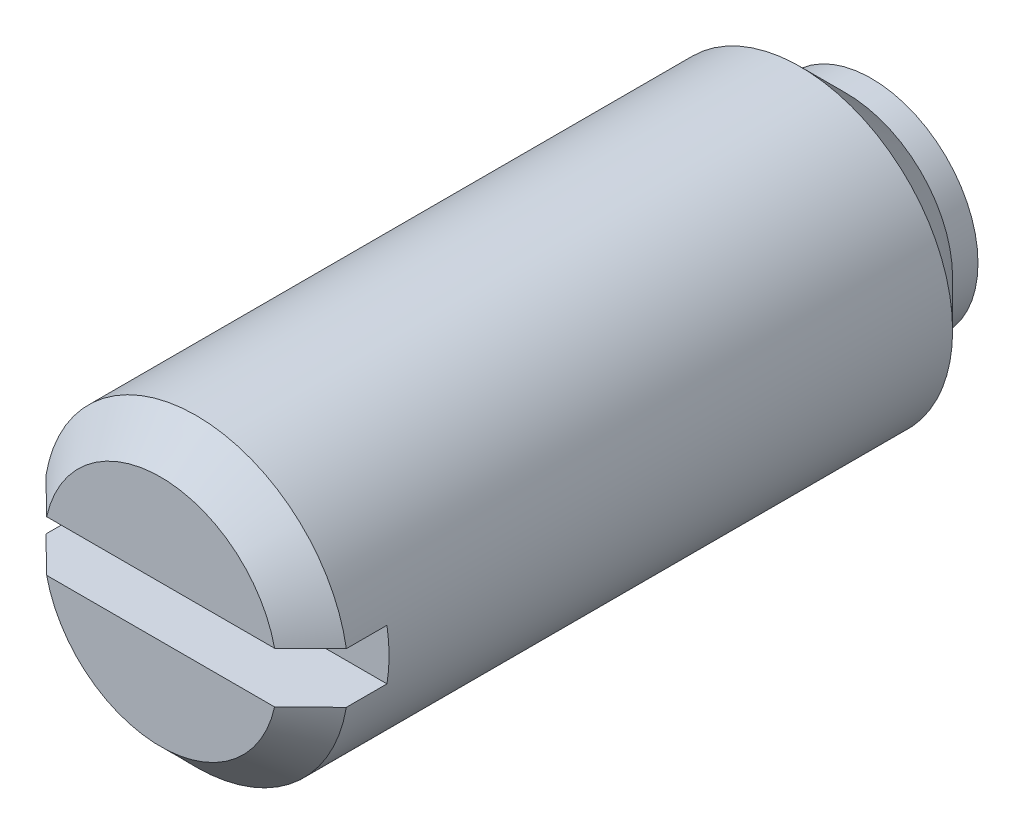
ISO-10303-21;
HEADER;
FILE_DESCRIPTION(('STEP AP214'),'2;1');
FILE_NAME('part.step','',(''),(''),'','','');
FILE_SCHEMA(('AUTOMOTIVE_DESIGN { 1 0 10303 214 1 1 1 1 }'));
ENDSEC;
DATA;
#1=APPLICATION_CONTEXT('core data for automotive mechanical design processes');
#2=APPLICATION_PROTOCOL_DEFINITION('international standard','automotive_design',2000,#1);
#3=PRODUCT_CONTEXT('',#1,'mechanical');
#4=PRODUCT('Part','Part','',(#3));
#5=PRODUCT_RELATED_PRODUCT_CATEGORY('part','',(#4));
#6=PRODUCT_DEFINITION_FORMATION('','',#4);
#7=PRODUCT_DEFINITION_CONTEXT('part definition',#1,'design');
#8=PRODUCT_DEFINITION('design','',#6,#7);
#9=PRODUCT_DEFINITION_SHAPE('','',#8);
#10=(LENGTH_UNIT() NAMED_UNIT(*) SI_UNIT(.MILLI.,.METRE.));
#11=(NAMED_UNIT(*) PLANE_ANGLE_UNIT() SI_UNIT($,.RADIAN.));
#12=(NAMED_UNIT(*) SI_UNIT($,.STERADIAN.) SOLID_ANGLE_UNIT());
#13=UNCERTAINTY_MEASURE_WITH_UNIT(LENGTH_MEASURE(1.E-05),#10,'distance_accuracy_value','');
#14=(GEOMETRIC_REPRESENTATION_CONTEXT(3) GLOBAL_UNCERTAINTY_ASSIGNED_CONTEXT((#13)) GLOBAL_UNIT_ASSIGNED_CONTEXT((#10,
#11,#12)) REPRESENTATION_CONTEXT('',''));
#15=CARTESIAN_POINT('',(0.,0.,0.));
#16=DIRECTION('',(0.,0.,1.));
#17=DIRECTION('',(1.,0.,0.));
#18=AXIS2_PLACEMENT_3D('',#15,#16,#17);
#19=CARTESIAN_POINT('',(0.,0.,-5.));
#20=DIRECTION('',(0.,0.,-1.));
#21=DIRECTION('',(-1.,0.,0.));
#22=AXIS2_PLACEMENT_3D('',#19,#20,#21);
#23=CYLINDRICAL_SURFACE('',#22,3.);
#24=DIRECTION('',(0.,0.,1.));
#25=VECTOR('',#24,1.);
#26=CARTESIAN_POINT('',(2.95803989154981,-0.5,13.5));
#27=LINE('',#26,#25);
#28=CARTESIAN_POINT('',(2.95803989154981,-0.5,13.5));
#29=VERTEX_POINT('',#28);
#30=CARTESIAN_POINT('',(2.95803989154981,-0.5,14.3));
#31=VERTEX_POINT('',#30);
#32=EDGE_CURVE('E83',#29,#31,#27,.T.);
#33=ORIENTED_EDGE('',*,*,#32,.T.);
#34=CARTESIAN_POINT('',(0.,0.,14.3));
#35=DIRECTION('',(0.,0.,1.));
#36=DIRECTION('',(1.,0.,0.));
#37=AXIS2_PLACEMENT_3D('',#34,#35,#36);
#38=CIRCLE('',#37,3.);
#39=CARTESIAN_POINT('',(-2.95803989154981,-0.5,14.3));
#40=VERTEX_POINT('',#39);
#41=EDGE_CURVE('E89',#31,#40,#38,.F.);
#42=ORIENTED_EDGE('',*,*,#41,.T.);
#43=DIRECTION('',(0.,0.,1.));
#44=VECTOR('',#43,1.);
#45=CARTESIAN_POINT('',(-2.95803989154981,-0.5,13.5));
#46=LINE('',#45,#44);
#47=CARTESIAN_POINT('',(-2.95803989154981,-0.5,13.5));
#48=VERTEX_POINT('',#47);
#49=EDGE_CURVE('E81',#48,#40,#46,.T.);
#50=ORIENTED_EDGE('',*,*,#49,.F.);
#51=CARTESIAN_POINT('',(0.,0.,13.5));
#52=DIRECTION('',(0.,0.,1.));
#53=DIRECTION('',(1.,0.,0.));
#54=AXIS2_PLACEMENT_3D('',#51,#52,#53);
#55=CIRCLE('',#54,3.);
#56=CARTESIAN_POINT('',(-2.95803989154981,0.5,13.5));
#57=VERTEX_POINT('',#56);
#58=EDGE_CURVE('E65',#57,#48,#55,.T.);
#59=ORIENTED_EDGE('',*,*,#58,.F.);
#60=DIRECTION('',(0.,0.,1.));
#61=VECTOR('',#60,1.);
#62=CARTESIAN_POINT('',(-2.95803989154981,0.5,13.5));
#63=LINE('',#62,#61);
#64=CARTESIAN_POINT('',(-2.95803989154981,0.5,14.3));
#65=VERTEX_POINT('',#64);
#66=EDGE_CURVE('E96',#57,#65,#63,.T.);
#67=ORIENTED_EDGE('',*,*,#66,.T.);
#68=CARTESIAN_POINT('',(0.,0.,14.3));
#69=DIRECTION('',(0.,0.,1.));
#70=DIRECTION('',(1.,0.,0.));
#71=AXIS2_PLACEMENT_3D('',#68,#69,#70);
#72=CIRCLE('',#71,3.);
#73=CARTESIAN_POINT('',(2.95803989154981,0.5,14.3));
#74=VERTEX_POINT('',#73);
#75=EDGE_CURVE('E101',#65,#74,#72,.F.);
#76=ORIENTED_EDGE('',*,*,#75,.T.);
#77=DIRECTION('',(0.,0.,1.));
#78=VECTOR('',#77,1.);
#79=CARTESIAN_POINT('',(2.95803989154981,0.5,13.5));
#80=LINE('',#79,#78);
#81=CARTESIAN_POINT('',(2.95803989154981,0.5,13.5));
#82=VERTEX_POINT('',#81);
#83=EDGE_CURVE('E91',#82,#74,#80,.T.);
#84=ORIENTED_EDGE('',*,*,#83,.F.);
#85=EDGE_CURVE('E77',#29,#82,#55,.T.);
#86=ORIENTED_EDGE('',*,*,#85,.F.);
#87=EDGE_LOOP('',(#33,#42,#50,#59,#67,#76,#84,#86));
#88=FACE_BOUND('',#87,.T.);
#89=CARTESIAN_POINT('',(0.,0.,2.4));
#90=DIRECTION('',(0.,0.,1.));
#91=DIRECTION('',(1.,0.,0.));
#92=AXIS2_PLACEMENT_3D('',#89,#90,#91);
#93=CIRCLE('',#92,3.);
#94=CARTESIAN_POINT('',(3.,0.,2.4));
#95=VERTEX_POINT('',#94);
#96=EDGE_CURVE('E165',#95,#95,#93,.T.);
#97=ORIENTED_EDGE('',*,*,#96,.T.);
#98=EDGE_LOOP('',(#97));
#99=FACE_BOUND('',#98,.T.);
#100=ADVANCED_FACE('F14',(#88,#99),#23,.T.);
#101=CARTESIAN_POINT('',(0.,3.,15.));
#102=DIRECTION('',(0.,0.,1.));
#103=DIRECTION('',(1.,0.,0.));
#104=AXIS2_PLACEMENT_3D('',#101,#102,#103);
#105=PLANE('',#104);
#106=DIRECTION('',(1.,0.,0.));
#107=VECTOR('',#106,1.);
#108=CARTESIAN_POINT('',(-2.95803989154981,0.5,15.));
#109=LINE('',#108,#107);
#110=CARTESIAN_POINT('',(-2.24499443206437,0.5,15.));
#111=VERTEX_POINT('',#110);
#112=CARTESIAN_POINT('',(2.24499443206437,0.5,15.));
#113=VERTEX_POINT('',#112);
#114=EDGE_CURVE('E75',#111,#113,#109,.T.);
#115=ORIENTED_EDGE('',*,*,#114,.T.);
#116=CARTESIAN_POINT('',(0.,0.,15.));
#117=DIRECTION('',(0.,0.,1.));
#118=DIRECTION('',(1.,0.,0.));
#119=AXIS2_PLACEMENT_3D('',#116,#117,#118);
#120=CIRCLE('',#119,2.3);
#121=EDGE_CURVE('E9',#113,#111,#120,.T.);
#122=ORIENTED_EDGE('',*,*,#121,.T.);
#123=EDGE_LOOP('',(#115,#122));
#124=FACE_BOUND('',#123,.T.);
#125=ADVANCED_FACE('F182',(#124),#105,.T.);
#126=DIRECTION('',(1.,0.,0.));
#127=VECTOR('',#126,1.);
#128=CARTESIAN_POINT('',(-2.95803989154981,-0.5,15.));
#129=LINE('',#128,#127);
#130=CARTESIAN_POINT('',(-2.24499443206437,-0.5,15.));
#131=VERTEX_POINT('',#130);
#132=CARTESIAN_POINT('',(2.24499443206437,-0.5,15.));
#133=VERTEX_POINT('',#132);
#134=EDGE_CURVE('E152',#131,#133,#129,.T.);
#135=ORIENTED_EDGE('',*,*,#134,.F.);
#136=CARTESIAN_POINT('',(0.,0.,15.));
#137=DIRECTION('',(0.,0.,1.));
#138=DIRECTION('',(1.,0.,0.));
#139=AXIS2_PLACEMENT_3D('',#136,#137,#138);
#140=CIRCLE('',#139,2.3);
#141=EDGE_CURVE('E146',#131,#133,#140,.T.);
#142=ORIENTED_EDGE('',*,*,#141,.T.);
#143=EDGE_LOOP('',(#135,#142));
#144=FACE_BOUND('',#143,.T.);
#145=ADVANCED_FACE('F132',(#144),#105,.T.);
#146=CARTESIAN_POINT('',(-2.95803989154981,0.5,13.5));
#147=DIRECTION('',(0.,-1.,0.));
#148=DIRECTION('',(1.,0.,0.));
#149=AXIS2_PLACEMENT_3D('',#146,#147,#148);
#150=PLANE('',#149);
#151=ORIENTED_EDGE('',*,*,#83,.T.);
#152=CARTESIAN_POINT('',(2.95803989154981,0.5,14.3));
#153=CARTESIAN_POINT('',(2.89874678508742,0.5,14.3584629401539));
#154=CARTESIAN_POINT('',(2.8394301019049,0.5,14.4169019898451));
#155=CARTESIAN_POINT('',(2.72073800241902,0.5,14.5337202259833));
#156=CARTESIAN_POINT('',(2.66136258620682,0.5,14.5920994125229));
#157=CARTESIAN_POINT('',(2.54254122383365,0.5,14.7087860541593));
#158=CARTESIAN_POINT('',(2.48309527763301,0.5,14.7670935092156));
#159=CARTESIAN_POINT('',(2.36411528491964,0.5,14.8836186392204));
#160=CARTESIAN_POINT('',(2.30458123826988,0.5,14.9418363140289));
#161=CARTESIAN_POINT('',(2.24499443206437,0.5,15.));
#162=B_SPLINE_CURVE_WITH_KNOTS('',3,(#152,#153,#154,#155,#156,#157,#158,#159,#160,#161),
.UNSPECIFIED.,.F.,.F.,(4,2,2,2,4),(0.,0.249804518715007,0.499608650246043,0.749412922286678,
0.999217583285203),.UNSPECIFIED.);
#163=EDGE_CURVE('E23',#74,#113,#162,.T.);
#164=ORIENTED_EDGE('',*,*,#163,.T.);
#165=ORIENTED_EDGE('',*,*,#114,.F.);
#166=CARTESIAN_POINT('',(-2.24499443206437,0.5,15.));
#167=CARTESIAN_POINT('',(-2.30458123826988,0.5,14.9418363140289));
#168=CARTESIAN_POINT('',(-2.36411528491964,0.5,14.8836186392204));
#169=CARTESIAN_POINT('',(-2.48309527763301,0.5,14.7670935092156));
#170=CARTESIAN_POINT('',(-2.54254122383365,0.5,14.7087860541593));
#171=CARTESIAN_POINT('',(-2.66136258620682,0.5,14.5920994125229));
#172=CARTESIAN_POINT('',(-2.72073800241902,0.5,14.5337202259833));
#173=CARTESIAN_POINT('',(-2.8394301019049,0.5,14.4169019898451));
#174=CARTESIAN_POINT('',(-2.89874678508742,0.5,14.3584629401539));
#175=CARTESIAN_POINT('',(-2.95803989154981,0.5,14.3));
#176=B_SPLINE_CURVE_WITH_KNOTS('',3,(#166,#167,#168,#169,#170,#171,#172,#173,#174,#175),
.UNSPECIFIED.,.F.,.F.,(4,2,2,2,4),(0.,0.249804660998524,0.49960893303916,0.749413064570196,
0.999217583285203),.UNSPECIFIED.);
#177=EDGE_CURVE('E137',#111,#65,#176,.T.);
#178=ORIENTED_EDGE('',*,*,#177,.T.);
#179=ORIENTED_EDGE('',*,*,#66,.F.);
#180=DIRECTION('',(1.,0.,0.));
#181=VECTOR('',#180,1.);
#182=CARTESIAN_POINT('',(-2.95803989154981,0.5,13.5));
#183=LINE('',#182,#181);
#184=EDGE_CURVE('E71',#57,#82,#183,.T.);
#185=ORIENTED_EDGE('',*,*,#184,.T.);
#186=EDGE_LOOP('',(#151,#164,#165,#178,#179,#185));
#187=FACE_BOUND('',#186,.T.);
#188=ADVANCED_FACE('F125',(#187),#150,.T.);
#189=CARTESIAN_POINT('',(-2.95803989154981,-0.5,13.5));
#190=DIRECTION('',(0.,-1.,0.));
#191=DIRECTION('',(1.,0.,0.));
#192=AXIS2_PLACEMENT_3D('',#189,#190,#191);
#193=PLANE('',#192);
#194=ORIENTED_EDGE('',*,*,#49,.T.);
#195=CARTESIAN_POINT('',(-2.95803989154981,-0.5,14.3));
#196=CARTESIAN_POINT('',(-2.89874678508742,-0.5,14.3584629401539));
#197=CARTESIAN_POINT('',(-2.8394301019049,-0.5,14.4169019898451));
#198=CARTESIAN_POINT('',(-2.72073800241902,-0.5,14.5337202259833));
#199=CARTESIAN_POINT('',(-2.66136258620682,-0.5,14.5920994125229));
#200=CARTESIAN_POINT('',(-2.54254122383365,-0.5,14.7087860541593));
#201=CARTESIAN_POINT('',(-2.48309527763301,-0.5,14.7670935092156));
#202=CARTESIAN_POINT('',(-2.36411528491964,-0.5,14.8836186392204));
#203=CARTESIAN_POINT('',(-2.30458123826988,-0.5,14.9418363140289));
#204=CARTESIAN_POINT('',(-2.24499443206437,-0.5,15.));
#205=B_SPLINE_CURVE_WITH_KNOTS('',3,(#195,#196,#197,#198,#199,#200,#201,#202,#203,#204),
.UNSPECIFIED.,.F.,.F.,(4,2,2,2,4),(0.,0.249804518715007,0.499608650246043,0.749412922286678,
0.999217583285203),.UNSPECIFIED.);
#206=EDGE_CURVE('E112',#40,#131,#205,.T.);
#207=ORIENTED_EDGE('',*,*,#206,.T.);
#208=ORIENTED_EDGE('',*,*,#134,.T.);
#209=CARTESIAN_POINT('',(2.24499443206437,-0.5,15.));
#210=CARTESIAN_POINT('',(2.30458123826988,-0.5,14.9418363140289));
#211=CARTESIAN_POINT('',(2.36411528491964,-0.5,14.8836186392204));
#212=CARTESIAN_POINT('',(2.48309527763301,-0.5,14.7670935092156));
#213=CARTESIAN_POINT('',(2.54254122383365,-0.5,14.7087860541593));
#214=CARTESIAN_POINT('',(2.66136258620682,-0.5,14.5920994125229));
#215=CARTESIAN_POINT('',(2.72073800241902,-0.5,14.5337202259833));
#216=CARTESIAN_POINT('',(2.8394301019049,-0.5,14.4169019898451));
#217=CARTESIAN_POINT('',(2.89874678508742,-0.5,14.3584629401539));
#218=CARTESIAN_POINT('',(2.95803989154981,-0.5,14.3));
#219=B_SPLINE_CURVE_WITH_KNOTS('',3,(#209,#210,#211,#212,#213,#214,#215,#216,#217,#218),
.UNSPECIFIED.,.F.,.F.,(4,2,2,2,4),(0.,0.249804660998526,0.49960893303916,0.749413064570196,
0.999217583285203),.UNSPECIFIED.);
#220=EDGE_CURVE('E105',#133,#31,#219,.T.);
#221=ORIENTED_EDGE('',*,*,#220,.T.);
#222=ORIENTED_EDGE('',*,*,#32,.F.);
#223=DIRECTION('',(1.,0.,0.));
#224=VECTOR('',#223,1.);
#225=CARTESIAN_POINT('',(-2.95803989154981,-0.5,13.5));
#226=LINE('',#225,#224);
#227=EDGE_CURVE('E68',#48,#29,#226,.T.);
#228=ORIENTED_EDGE('',*,*,#227,.F.);
#229=EDGE_LOOP('',(#194,#207,#208,#221,#222,#228));
#230=FACE_BOUND('',#229,.T.);
#231=ADVANCED_FACE('F80',(#230),#193,.F.);
#232=CARTESIAN_POINT('',(0.,0.,13.5));
#233=DIRECTION('',(0.,0.,1.));
#234=DIRECTION('',(1.,0.,0.));
#235=AXIS2_PLACEMENT_3D('',#232,#233,#234);
#236=PLANE('',#235);
#237=ORIENTED_EDGE('',*,*,#58,.T.);
#238=ORIENTED_EDGE('',*,*,#227,.T.);
#239=ORIENTED_EDGE('',*,*,#85,.T.);
#240=ORIENTED_EDGE('',*,*,#184,.F.);
#241=EDGE_LOOP('',(#237,#238,#239,#240));
#242=FACE_BOUND('',#241,.T.);
#243=ADVANCED_FACE('F67',(#242),#236,.T.);
#244=CARTESIAN_POINT('',(0.,0.,17.3277959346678));
#245=DIRECTION('',(0.,0.,1.));
#246=DIRECTION('',(1.,0.,0.));
#247=AXIS2_PLACEMENT_3D('',#244,#245,#246);
#248=CYLINDRICAL_SURFACE('',#247,2.1);
#249=CARTESIAN_POINT('',(0.,0.,1.));
#250=DIRECTION('',(0.,0.,1.));
#251=DIRECTION('',(1.,0.,0.));
#252=AXIS2_PLACEMENT_3D('',#249,#250,#251);
#253=CIRCLE('',#252,2.1);
#254=CARTESIAN_POINT('',(2.1,0.,1.));
#255=VERTEX_POINT('',#254);
#256=EDGE_CURVE('E155',#255,#255,#253,.T.);
#257=ORIENTED_EDGE('',*,*,#256,.T.);
#258=EDGE_LOOP('',(#257));
#259=FACE_BOUND('',#258,.T.);
#260=CARTESIAN_POINT('',(0.,0.,1.5));
#261=DIRECTION('',(0.,0.,1.));
#262=DIRECTION('',(1.,0.,0.));
#263=AXIS2_PLACEMENT_3D('',#260,#261,#262);
#264=CIRCLE('',#263,2.1);
#265=CARTESIAN_POINT('',(2.1,0.,1.5));
#266=VERTEX_POINT('',#265);
#267=EDGE_CURVE('E162',#266,#266,#264,.T.);
#268=ORIENTED_EDGE('',*,*,#267,.F.);
#269=EDGE_LOOP('',(#268));
#270=FACE_BOUND('',#269,.T.);
#271=ADVANCED_FACE('F126',(#259,#270),#248,.T.);
#272=CARTESIAN_POINT('',(0.,0.,2.4));
#273=DIRECTION('',(0.,0.,1.));
#274=DIRECTION('',(1.,0.,0.));
#275=AXIS2_PLACEMENT_3D('',#272,#273,#274);
#276=CONICAL_SURFACE('',#275,3.,0.785398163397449);
#277=ORIENTED_EDGE('',*,*,#267,.T.);
#278=EDGE_LOOP('',(#277));
#279=FACE_BOUND('',#278,.T.);
#280=ORIENTED_EDGE('',*,*,#96,.F.);
#281=EDGE_LOOP('',(#280));
#282=FACE_BOUND('',#281,.T.);
#283=ADVANCED_FACE('F169',(#279,#282),#276,.T.);
#284=CARTESIAN_POINT('',(0.,0.,1.75));
#285=DIRECTION('',(-1.,0.,0.));
#286=DIRECTION('',(0.,0.,1.));
#287=AXIS2_PLACEMENT_3D('',#284,#285,#286);
#288=SPHERICAL_SURFACE('',#287,1.75);
#289=CARTESIAN_POINT('',(0.,0.,1.75));
#290=DIRECTION('',(0.,0.,-1.));
#291=DIRECTION('',(-1.,0.,0.));
#292=AXIS2_PLACEMENT_3D('',#289,#290,#291);
#293=SPHERICAL_SURFACE('',#292,1.75);
#294=CARTESIAN_POINT('',(0.,0.,1.));
#295=DIRECTION('',(0.,0.,-1.));
#296=DIRECTION('',(-1.,0.,0.));
#297=AXIS2_PLACEMENT_3D('',#294,#295,#296);
#298=CIRCLE('',#297,1.58113883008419);
#299=CARTESIAN_POINT('',(-1.58113883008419,0.,1.));
#300=VERTEX_POINT('',#299);
#301=EDGE_CURVE('E98',#300,#300,#298,.T.);
#302=ORIENTED_EDGE('',*,*,#301,.T.);
#303=EDGE_LOOP('',(#302));
#304=FACE_BOUND('',#303,.T.);
#305=ADVANCED_FACE('F171',(#304),#293,.T.);
#306=CARTESIAN_POINT('',(0.,1.58113883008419,1.));
#307=DIRECTION('',(0.,0.,-1.));
#308=DIRECTION('',(-1.,0.,0.));
#309=AXIS2_PLACEMENT_3D('',#306,#307,#308);
#310=PLANE('',#309);
#311=ORIENTED_EDGE('',*,*,#301,.F.);
#312=EDGE_LOOP('',(#311));
#313=FACE_BOUND('',#312,.T.);
#314=ORIENTED_EDGE('',*,*,#256,.F.);
#315=EDGE_LOOP('',(#314));
#316=FACE_BOUND('',#315,.T.);
#317=ADVANCED_FACE('F133',(#313,#316),#310,.T.);
#318=CARTESIAN_POINT('',(0.,0.,14.3));
#319=DIRECTION('',(0.,0.,-1.));
#320=DIRECTION('',(-1.,0.,0.));
#321=AXIS2_PLACEMENT_3D('',#318,#319,#320);
#322=CONICAL_SURFACE('',#321,3.,0.785398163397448);
#323=ORIENTED_EDGE('',*,*,#220,.F.);
#324=ORIENTED_EDGE('',*,*,#141,.F.);
#325=ORIENTED_EDGE('',*,*,#206,.F.);
#326=ORIENTED_EDGE('',*,*,#41,.F.);
#327=EDGE_LOOP('',(#323,#324,#325,#326));
#328=FACE_BOUND('',#327,.T.);
#329=ADVANCED_FACE('F118',(#328),#322,.T.);
#330=CARTESIAN_POINT('',(0.,0.,14.3));
#331=DIRECTION('',(0.,0.,-1.));
#332=DIRECTION('',(-1.,0.,0.));
#333=AXIS2_PLACEMENT_3D('',#330,#331,#332);
#334=CONICAL_SURFACE('',#333,3.,0.785398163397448);
#335=ORIENTED_EDGE('',*,*,#177,.F.);
#336=ORIENTED_EDGE('',*,*,#121,.F.);
#337=ORIENTED_EDGE('',*,*,#163,.F.);
#338=ORIENTED_EDGE('',*,*,#75,.F.);
#339=EDGE_LOOP('',(#335,#336,#337,#338));
#340=FACE_BOUND('',#339,.T.);
#341=ADVANCED_FACE('F16',(#340),#334,.T.);
#342=CLOSED_SHELL('',(#100,#125,#145,#188,#231,#243,#271,#283,#305,#317,#329,#341));
#343=MANIFOLD_SOLID_BREP('B1',#342);
#344=ADVANCED_BREP_SHAPE_REPRESENTATION('',(#18,#343),#14);
#345=SHAPE_DEFINITION_REPRESENTATION(#9,#344);
ENDSEC;
END-ISO-10303-21;
